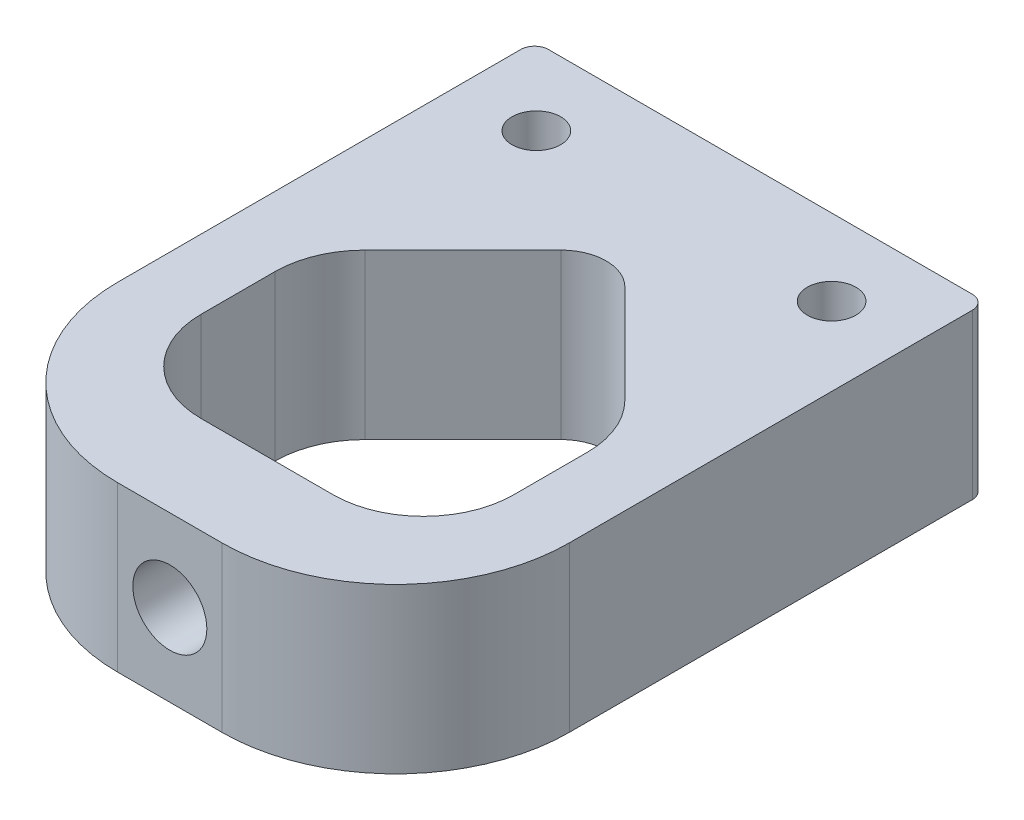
ISO-10303-21;
HEADER;
FILE_DESCRIPTION(('STEP AP214'),'2;1');
FILE_NAME('part.step','',(''),(''),'','','');
FILE_SCHEMA(('AUTOMOTIVE_DESIGN { 1 0 10303 214 1 1 1 1 }'));
ENDSEC;
DATA;
#1=APPLICATION_CONTEXT('core data for automotive mechanical design processes');
#2=APPLICATION_PROTOCOL_DEFINITION('international standard','automotive_design',2000,#1);
#3=PRODUCT_CONTEXT('',#1,'mechanical');
#4=PRODUCT('Part','Part','',(#3));
#5=PRODUCT_RELATED_PRODUCT_CATEGORY('part','',(#4));
#6=PRODUCT_DEFINITION_FORMATION('','',#4);
#7=PRODUCT_DEFINITION_CONTEXT('part definition',#1,'design');
#8=PRODUCT_DEFINITION('design','',#6,#7);
#9=PRODUCT_DEFINITION_SHAPE('','',#8);
#10=(LENGTH_UNIT() NAMED_UNIT(*) SI_UNIT(.MILLI.,.METRE.));
#11=(NAMED_UNIT(*) PLANE_ANGLE_UNIT() SI_UNIT($,.RADIAN.));
#12=(NAMED_UNIT(*) SI_UNIT($,.STERADIAN.) SOLID_ANGLE_UNIT());
#13=UNCERTAINTY_MEASURE_WITH_UNIT(LENGTH_MEASURE(1.E-05),#10,'distance_accuracy_value','');
#14=(GEOMETRIC_REPRESENTATION_CONTEXT(3) GLOBAL_UNCERTAINTY_ASSIGNED_CONTEXT((#13)) GLOBAL_UNIT_ASSIGNED_CONTEXT((#10,
#11,#12)) REPRESENTATION_CONTEXT('',''));
#15=CARTESIAN_POINT('',(0.,0.,0.));
#16=DIRECTION('',(0.,0.,1.));
#17=DIRECTION('',(1.,0.,0.));
#18=AXIS2_PLACEMENT_3D('',#15,#16,#17);
#19=CARTESIAN_POINT('',(-27.0045688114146,6.,-23.0124921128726));
#20=DIRECTION('',(1.,0.,0.));
#21=DIRECTION('',(0.,0.,-1.));
#22=AXIS2_PLACEMENT_3D('',#19,#20,#21);
#23=PLANE('',#22);
#24=DIRECTION('',(0.,0.,1.));
#25=VECTOR('',#24,1.);
#26=CARTESIAN_POINT('',(-27.0045688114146,0.,-23.0124921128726));
#27=LINE('',#26,#25);
#28=CARTESIAN_POINT('',(-27.0045688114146,0.,-22.5044921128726));
#29=VERTEX_POINT('',#28);
#30=CARTESIAN_POINT('',(-27.0045688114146,0.,-7.77249211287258));
#31=VERTEX_POINT('',#30);
#32=EDGE_CURVE('E179',#29,#31,#27,.T.);
#33=ORIENTED_EDGE('',*,*,#32,.T.);
#34=DIRECTION('',(0.,-1.,0.));
#35=VECTOR('',#34,1.);
#36=CARTESIAN_POINT('',(-27.0045688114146,6.,-7.77249211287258));
#37=LINE('',#36,#35);
#38=CARTESIAN_POINT('',(-27.0045688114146,6.,-7.77249211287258));
#39=VERTEX_POINT('',#38);
#40=EDGE_CURVE('E223',#31,#39,#37,.F.);
#41=ORIENTED_EDGE('',*,*,#40,.T.);
#42=DIRECTION('',(0.,0.,1.));
#43=VECTOR('',#42,1.);
#44=CARTESIAN_POINT('',(-27.0045688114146,6.,-23.0124921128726));
#45=LINE('',#44,#43);
#46=CARTESIAN_POINT('',(-27.0045688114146,6.,-22.5044921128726));
#47=VERTEX_POINT('',#46);
#48=EDGE_CURVE('E182',#47,#39,#45,.T.);
#49=ORIENTED_EDGE('',*,*,#48,.F.);
#50=DIRECTION('',(0.,-1.,0.));
#51=VECTOR('',#50,1.);
#52=CARTESIAN_POINT('',(-27.0045688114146,6.,-22.5044921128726));
#53=LINE('',#52,#51);
#54=EDGE_CURVE('E167',#47,#29,#53,.T.);
#55=ORIENTED_EDGE('',*,*,#54,.T.);
#56=EDGE_LOOP('',(#33,#41,#49,#55));
#57=FACE_BOUND('',#56,.T.);
#58=ADVANCED_FACE('F38',(#57),#23,.F.);
#59=CARTESIAN_POINT('',(-27.0045688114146,6.,-1.42249211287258));
#60=DIRECTION('',(0.,0.,-1.));
#61=DIRECTION('',(-1.,0.,0.));
#62=AXIS2_PLACEMENT_3D('',#59,#60,#61);
#63=PLANE('',#62);
#64=CARTESIAN_POINT('',(-18.7495688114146,3.,-1.42249211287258));
#65=DIRECTION('',(0.,0.,1.));
#66=DIRECTION('',(1.,0.,0.));
#67=AXIS2_PLACEMENT_3D('',#64,#65,#66);
#68=CIRCLE('',#67,1.35254999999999);
#69=CARTESIAN_POINT('',(-17.3970188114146,3.,-1.42249211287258));
#70=VERTEX_POINT('',#69);
#71=EDGE_CURVE('E292',#70,#70,#68,.T.);
#72=ORIENTED_EDGE('',*,*,#71,.F.);
#73=EDGE_LOOP('',(#72));
#74=FACE_BOUND('',#73,.T.);
#75=DIRECTION('',(1.,0.,0.));
#76=VECTOR('',#75,1.);
#77=CARTESIAN_POINT('',(-27.0045688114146,6.,-1.42249211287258));
#78=LINE('',#77,#76);
#79=CARTESIAN_POINT('',(-20.6545688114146,6.,-1.42249211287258));
#80=VERTEX_POINT('',#79);
#81=CARTESIAN_POINT('',(-16.8445688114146,6.,-1.42249211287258));
#82=VERTEX_POINT('',#81);
#83=EDGE_CURVE('E314',#80,#82,#78,.T.);
#84=ORIENTED_EDGE('',*,*,#83,.F.);
#85=DIRECTION('',(0.,-1.,0.));
#86=VECTOR('',#85,1.);
#87=CARTESIAN_POINT('',(-20.6545688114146,6.,-1.42249211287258));
#88=LINE('',#87,#86);
#89=CARTESIAN_POINT('',(-20.6545688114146,0.,-1.42249211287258));
#90=VERTEX_POINT('',#89);
#91=EDGE_CURVE('E217',#80,#90,#88,.T.);
#92=ORIENTED_EDGE('',*,*,#91,.T.);
#93=DIRECTION('',(1.,0.,0.));
#94=VECTOR('',#93,1.);
#95=CARTESIAN_POINT('',(-27.0045688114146,0.,-1.42249211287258));
#96=LINE('',#95,#94);
#97=CARTESIAN_POINT('',(-16.8445688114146,0.,-1.42249211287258));
#98=VERTEX_POINT('',#97);
#99=EDGE_CURVE('E188',#90,#98,#96,.T.);
#100=ORIENTED_EDGE('',*,*,#99,.T.);
#101=DIRECTION('',(0.,-1.,0.));
#102=VECTOR('',#101,1.);
#103=CARTESIAN_POINT('',(-16.8445688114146,6.,-1.42249211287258));
#104=LINE('',#103,#102);
#105=EDGE_CURVE('E215',#98,#82,#104,.F.);
#106=ORIENTED_EDGE('',*,*,#105,.T.);
#107=EDGE_LOOP('',(#84,#92,#100,#106));
#108=FACE_BOUND('',#107,.T.);
#109=ADVANCED_FACE('F338',(#74,#108),#63,.F.);
#110=CARTESIAN_POINT('',(-10.4945688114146,6.,-23.0124921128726));
#111=DIRECTION('',(-1.,0.,0.));
#112=DIRECTION('',(0.,0.,1.));
#113=AXIS2_PLACEMENT_3D('',#110,#111,#112);
#114=PLANE('',#113);
#115=DIRECTION('',(0.,0.,-1.));
#116=VECTOR('',#115,1.);
#117=CARTESIAN_POINT('',(-10.4945688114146,6.,-23.0124921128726));
#118=LINE('',#117,#116);
#119=CARTESIAN_POINT('',(-10.4945688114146,6.,-7.77249211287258));
#120=VERTEX_POINT('',#119);
#121=CARTESIAN_POINT('',(-10.4945688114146,6.,-22.5044921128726));
#122=VERTEX_POINT('',#121);
#123=EDGE_CURVE('E316',#120,#122,#118,.T.);
#124=ORIENTED_EDGE('',*,*,#123,.F.);
#125=DIRECTION('',(0.,-1.,0.));
#126=VECTOR('',#125,1.);
#127=CARTESIAN_POINT('',(-10.4945688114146,6.,-7.77249211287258));
#128=LINE('',#127,#126);
#129=CARTESIAN_POINT('',(-10.4945688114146,0.,-7.77249211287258));
#130=VERTEX_POINT('',#129);
#131=EDGE_CURVE('E229',#120,#130,#128,.T.);
#132=ORIENTED_EDGE('',*,*,#131,.T.);
#133=DIRECTION('',(0.,0.,-1.));
#134=VECTOR('',#133,1.);
#135=CARTESIAN_POINT('',(-10.4945688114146,0.,-23.0124921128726));
#136=LINE('',#135,#134);
#137=CARTESIAN_POINT('',(-10.4945688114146,0.,-22.5044921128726));
#138=VERTEX_POINT('',#137);
#139=EDGE_CURVE('E192',#130,#138,#136,.T.);
#140=ORIENTED_EDGE('',*,*,#139,.T.);
#141=DIRECTION('',(0.,-1.,0.));
#142=VECTOR('',#141,1.);
#143=CARTESIAN_POINT('',(-10.4945688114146,6.,-22.5044921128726));
#144=LINE('',#143,#142);
#145=EDGE_CURVE('E212',#138,#122,#144,.F.);
#146=ORIENTED_EDGE('',*,*,#145,.T.);
#147=EDGE_LOOP('',(#124,#132,#140,#146));
#148=FACE_BOUND('',#147,.T.);
#149=ADVANCED_FACE('F330',(#148),#114,.F.);
#150=CARTESIAN_POINT('',(-27.0045688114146,6.,-23.0124921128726));
#151=DIRECTION('',(0.,0.,1.));
#152=DIRECTION('',(1.,0.,0.));
#153=AXIS2_PLACEMENT_3D('',#150,#151,#152);
#154=PLANE('',#153);
#155=DIRECTION('',(-1.,0.,0.));
#156=VECTOR('',#155,1.);
#157=CARTESIAN_POINT('',(-27.0045688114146,0.,-23.0124921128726));
#158=LINE('',#157,#156);
#159=CARTESIAN_POINT('',(-11.0025688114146,0.,-23.0124921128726));
#160=VERTEX_POINT('',#159);
#161=CARTESIAN_POINT('',(-26.4965688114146,0.,-23.0124921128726));
#162=VERTEX_POINT('',#161);
#163=EDGE_CURVE('E201',#160,#162,#158,.T.);
#164=ORIENTED_EDGE('',*,*,#163,.T.);
#165=DIRECTION('',(0.,-1.,0.));
#166=VECTOR('',#165,1.);
#167=CARTESIAN_POINT('',(-26.4965688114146,6.,-23.0124921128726));
#168=LINE('',#167,#166);
#169=CARTESIAN_POINT('',(-26.4965688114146,6.,-23.0124921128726));
#170=VERTEX_POINT('',#169);
#171=EDGE_CURVE('E168',#162,#170,#168,.F.);
#172=ORIENTED_EDGE('',*,*,#171,.T.);
#173=DIRECTION('',(-1.,0.,0.));
#174=VECTOR('',#173,1.);
#175=CARTESIAN_POINT('',(-27.0045688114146,6.,-23.0124921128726));
#176=LINE('',#175,#174);
#177=CARTESIAN_POINT('',(-11.0025688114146,6.,-23.0124921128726));
#178=VERTEX_POINT('',#177);
#179=EDGE_CURVE('E183',#178,#170,#176,.T.);
#180=ORIENTED_EDGE('',*,*,#179,.F.);
#181=DIRECTION('',(0.,-1.,0.));
#182=VECTOR('',#181,1.);
#183=CARTESIAN_POINT('',(-11.0025688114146,6.,-23.0124921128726));
#184=LINE('',#183,#182);
#185=EDGE_CURVE('E173',#178,#160,#184,.T.);
#186=ORIENTED_EDGE('',*,*,#185,.T.);
#187=EDGE_LOOP('',(#164,#172,#180,#186));
#188=FACE_BOUND('',#187,.T.);
#189=ADVANCED_FACE('F324',(#188),#154,.F.);
#190=CARTESIAN_POINT('',(0.,6.,0.));
#191=DIRECTION('',(0.,1.,0.));
#192=DIRECTION('',(0.,0.,1.));
#193=AXIS2_PLACEMENT_3D('',#190,#191,#192);
#194=PLANE('',#193);
#195=DIRECTION('',(-0.707106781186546,0.,0.707106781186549));
#196=VECTOR('',#195,1.);
#197=CARTESIAN_POINT('',(-24.4645688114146,6.,-12.3444921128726));
#198=LINE('',#197,#196);
#199=CARTESIAN_POINT('',(-19.9170021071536,6.,-16.8920588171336));
#200=VERTEX_POINT('',#199);
#201=CARTESIAN_POINT('',(-23.4974354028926,6.,-13.3116255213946));
#202=VERTEX_POINT('',#201);
#203=EDGE_CURVE('E277',#200,#202,#198,.T.);
#204=ORIENTED_EDGE('',*,*,#203,.F.);
#205=CARTESIAN_POINT('',(-18.7495688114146,6.,-15.7246255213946));
#206=DIRECTION('',(0.,1.,0.));
#207=DIRECTION('',(0.,0.,1.));
#208=AXIS2_PLACEMENT_3D('',#205,#206,#207);
#209=CIRCLE('',#208,1.651);
#210=CARTESIAN_POINT('',(-17.5821355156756,6.,-16.8920588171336));
#211=VERTEX_POINT('',#210);
#212=EDGE_CURVE('E46',#200,#211,#209,.F.);
#213=ORIENTED_EDGE('',*,*,#212,.T.);
#214=DIRECTION('',(-0.707106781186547,0.,-0.707106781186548));
#215=VECTOR('',#214,1.);
#216=CARTESIAN_POINT('',(-18.7495688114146,6.,-18.0594921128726));
#217=LINE('',#216,#215);
#218=CARTESIAN_POINT('',(-14.0017022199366,6.,-13.3116255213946));
#219=VERTEX_POINT('',#218);
#220=EDGE_CURVE('E303',#219,#211,#217,.T.);
#221=ORIENTED_EDGE('',*,*,#220,.F.);
#222=CARTESIAN_POINT('',(-16.3365688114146,6.,-10.9767589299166));
#223=DIRECTION('',(0.,1.,0.));
#224=DIRECTION('',(0.,0.,1.));
#225=AXIS2_PLACEMENT_3D('',#222,#223,#224);
#226=CIRCLE('',#225,3.302);
#227=CARTESIAN_POINT('',(-13.0345688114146,6.,-10.9767589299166));
#228=VERTEX_POINT('',#227);
#229=EDGE_CURVE('E261',#219,#228,#226,.F.);
#230=ORIENTED_EDGE('',*,*,#229,.T.);
#231=DIRECTION('',(0.,0.,-1.));
#232=VECTOR('',#231,1.);
#233=CARTESIAN_POINT('',(-13.0345688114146,6.,-4.97849211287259));
#234=LINE('',#233,#232);
#235=CARTESIAN_POINT('',(-13.0345688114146,6.,-8.28049211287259));
#236=VERTEX_POINT('',#235);
#237=EDGE_CURVE('E300',#236,#228,#234,.T.);
#238=ORIENTED_EDGE('',*,*,#237,.F.);
#239=CARTESIAN_POINT('',(-16.3365688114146,6.,-8.28049211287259));
#240=DIRECTION('',(0.,1.,0.));
#241=DIRECTION('',(0.,0.,1.));
#242=AXIS2_PLACEMENT_3D('',#239,#240,#241);
#243=CIRCLE('',#242,3.302);
#244=CARTESIAN_POINT('',(-16.3365688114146,6.,-4.97849211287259));
#245=VERTEX_POINT('',#244);
#246=EDGE_CURVE('E253',#236,#245,#243,.F.);
#247=ORIENTED_EDGE('',*,*,#246,.T.);
#248=DIRECTION('',(1.,0.,0.));
#249=VECTOR('',#248,1.);
#250=CARTESIAN_POINT('',(-24.4645688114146,6.,-4.97849211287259));
#251=LINE('',#250,#249);
#252=CARTESIAN_POINT('',(-21.1625688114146,6.,-4.97849211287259));
#253=VERTEX_POINT('',#252);
#254=EDGE_CURVE('E289',#253,#245,#251,.T.);
#255=ORIENTED_EDGE('',*,*,#254,.F.);
#256=CARTESIAN_POINT('',(-21.1625688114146,6.,-8.28049211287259));
#257=DIRECTION('',(0.,1.,0.));
#258=DIRECTION('',(0.,0.,1.));
#259=AXIS2_PLACEMENT_3D('',#256,#257,#258);
#260=CIRCLE('',#259,3.302);
#261=CARTESIAN_POINT('',(-24.4645688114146,6.,-8.28049211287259));
#262=VERTEX_POINT('',#261);
#263=EDGE_CURVE('E257',#253,#262,#260,.F.);
#264=ORIENTED_EDGE('',*,*,#263,.T.);
#265=DIRECTION('',(0.,0.,1.));
#266=VECTOR('',#265,1.);
#267=CARTESIAN_POINT('',(-24.4645688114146,6.,-4.97849211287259));
#268=LINE('',#267,#266);
#269=CARTESIAN_POINT('',(-24.4645688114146,6.,-10.9767589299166));
#270=VERTEX_POINT('',#269);
#271=EDGE_CURVE('E285',#270,#262,#268,.T.);
#272=ORIENTED_EDGE('',*,*,#271,.F.);
#273=CARTESIAN_POINT('',(-21.1625688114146,6.,-10.9767589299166));
#274=DIRECTION('',(0.,1.,0.));
#275=DIRECTION('',(0.,0.,1.));
#276=AXIS2_PLACEMENT_3D('',#273,#274,#275);
#277=CIRCLE('',#276,3.302);
#278=EDGE_CURVE('E265',#270,#202,#277,.F.);
#279=ORIENTED_EDGE('',*,*,#278,.T.);
#280=EDGE_LOOP('',(#204,#213,#221,#230,#238,#247,#255,#264,#272,#279));
#281=FACE_BOUND('',#280,.T.);
#282=CARTESIAN_POINT('',(-24.1470688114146,6.,-20.2184921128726));
#283=DIRECTION('',(0.,1.,0.));
#284=DIRECTION('',(0.,0.,1.));
#285=AXIS2_PLACEMENT_3D('',#282,#283,#284);
#286=CIRCLE('',#285,0.889000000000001);
#287=CARTESIAN_POINT('',(-24.1470688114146,6.,-19.3294921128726));
#288=VERTEX_POINT('',#287);
#289=EDGE_CURVE('E305',#288,#288,#286,.T.);
#290=ORIENTED_EDGE('',*,*,#289,.F.);
#291=EDGE_LOOP('',(#290));
#292=FACE_BOUND('',#291,.T.);
#293=CARTESIAN_POINT('',(-13.3520688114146,6.,-20.2184921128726));
#294=DIRECTION('',(0.,1.,0.));
#295=DIRECTION('',(0.,0.,1.));
#296=AXIS2_PLACEMENT_3D('',#293,#294,#295);
#297=CIRCLE('',#296,0.888999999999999);
#298=CARTESIAN_POINT('',(-13.3520688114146,6.,-19.3294921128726));
#299=VERTEX_POINT('',#298);
#300=EDGE_CURVE('E195',#299,#299,#297,.T.);
#301=ORIENTED_EDGE('',*,*,#300,.F.);
#302=EDGE_LOOP('',(#301));
#303=FACE_BOUND('',#302,.T.);
#304=ORIENTED_EDGE('',*,*,#48,.T.);
#305=CARTESIAN_POINT('',(-20.6545688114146,6.,-7.77249211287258));
#306=DIRECTION('',(0.,1.,0.));
#307=DIRECTION('',(0.,0.,1.));
#308=AXIS2_PLACEMENT_3D('',#305,#306,#307);
#309=CIRCLE('',#308,6.35);
#310=EDGE_CURVE('E227',#39,#80,#309,.T.);
#311=ORIENTED_EDGE('',*,*,#310,.T.);
#312=ORIENTED_EDGE('',*,*,#83,.T.);
#313=CARTESIAN_POINT('',(-16.8445688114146,6.,-7.77249211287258));
#314=DIRECTION('',(0.,1.,0.));
#315=DIRECTION('',(0.,0.,1.));
#316=AXIS2_PLACEMENT_3D('',#313,#314,#315);
#317=CIRCLE('',#316,6.35);
#318=EDGE_CURVE('E225',#82,#120,#317,.T.);
#319=ORIENTED_EDGE('',*,*,#318,.T.);
#320=ORIENTED_EDGE('',*,*,#123,.T.);
#321=CARTESIAN_POINT('',(-11.0025688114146,6.,-22.5044921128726));
#322=DIRECTION('',(0.,1.,0.));
#323=DIRECTION('',(0.,0.,1.));
#324=AXIS2_PLACEMENT_3D('',#321,#322,#323);
#325=CIRCLE('',#324,0.508);
#326=EDGE_CURVE('E208',#122,#178,#325,.T.);
#327=ORIENTED_EDGE('',*,*,#326,.T.);
#328=ORIENTED_EDGE('',*,*,#179,.T.);
#329=CARTESIAN_POINT('',(-26.4965688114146,6.,-22.5044921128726));
#330=DIRECTION('',(0.,1.,0.));
#331=DIRECTION('',(0.,0.,1.));
#332=AXIS2_PLACEMENT_3D('',#329,#330,#331);
#333=CIRCLE('',#332,0.508);
#334=EDGE_CURVE('E210',#170,#47,#333,.T.);
#335=ORIENTED_EDGE('',*,*,#334,.T.);
#336=EDGE_LOOP('',(#304,#311,#312,#319,#320,#327,#328,#335));
#337=FACE_BOUND('',#336,.T.);
#338=ADVANCED_FACE('F281',(#281,#292,#303,#337),#194,.T.);
#339=CARTESIAN_POINT('',(0.,0.,0.));
#340=DIRECTION('',(0.,1.,0.));
#341=DIRECTION('',(0.,0.,1.));
#342=AXIS2_PLACEMENT_3D('',#339,#340,#341);
#343=PLANE('',#342);
#344=DIRECTION('',(0.,0.,-1.));
#345=VECTOR('',#344,1.);
#346=CARTESIAN_POINT('',(-13.0345688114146,0.,-4.97849211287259));
#347=LINE('',#346,#345);
#348=CARTESIAN_POINT('',(-13.0345688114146,0.,-8.28049211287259));
#349=VERTEX_POINT('',#348);
#350=CARTESIAN_POINT('',(-13.0345688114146,0.,-10.9767589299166));
#351=VERTEX_POINT('',#350);
#352=EDGE_CURVE('E584',#349,#351,#347,.T.);
#353=ORIENTED_EDGE('',*,*,#352,.T.);
#354=CARTESIAN_POINT('',(-16.3365688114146,0.,-10.9767589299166));
#355=DIRECTION('',(0.,1.,0.));
#356=DIRECTION('',(0.,0.,1.));
#357=AXIS2_PLACEMENT_3D('',#354,#355,#356);
#358=CIRCLE('',#357,3.302);
#359=CARTESIAN_POINT('',(-14.0017022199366,0.,-13.3116255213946));
#360=VERTEX_POINT('',#359);
#361=EDGE_CURVE('E263',#351,#360,#358,.T.);
#362=ORIENTED_EDGE('',*,*,#361,.T.);
#363=DIRECTION('',(-0.707106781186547,0.,-0.707106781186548));
#364=VECTOR('',#363,1.);
#365=CARTESIAN_POINT('',(-18.7495688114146,0.,-18.0594921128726));
#366=LINE('',#365,#364);
#367=CARTESIAN_POINT('',(-17.5821355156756,0.,-16.8920588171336));
#368=VERTEX_POINT('',#367);
#369=EDGE_CURVE('E295',#360,#368,#366,.T.);
#370=ORIENTED_EDGE('',*,*,#369,.T.);
#371=CARTESIAN_POINT('',(-18.7495688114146,0.,-15.7246255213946));
#372=DIRECTION('',(0.,1.,0.));
#373=DIRECTION('',(0.,0.,1.));
#374=AXIS2_PLACEMENT_3D('',#371,#372,#373);
#375=CIRCLE('',#374,1.651);
#376=CARTESIAN_POINT('',(-19.9170021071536,0.,-16.8920588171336));
#377=VERTEX_POINT('',#376);
#378=EDGE_CURVE('E11',#368,#377,#375,.T.);
#379=ORIENTED_EDGE('',*,*,#378,.T.);
#380=DIRECTION('',(-0.707106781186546,0.,0.707106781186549));
#381=VECTOR('',#380,1.);
#382=CARTESIAN_POINT('',(-24.4645688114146,0.,-12.3444921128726));
#383=LINE('',#382,#381);
#384=CARTESIAN_POINT('',(-23.4974354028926,0.,-13.3116255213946));
#385=VERTEX_POINT('',#384);
#386=EDGE_CURVE('E278',#377,#385,#383,.T.);
#387=ORIENTED_EDGE('',*,*,#386,.T.);
#388=CARTESIAN_POINT('',(-21.1625688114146,0.,-10.9767589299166));
#389=DIRECTION('',(0.,1.,0.));
#390=DIRECTION('',(0.,0.,1.));
#391=AXIS2_PLACEMENT_3D('',#388,#389,#390);
#392=CIRCLE('',#391,3.302);
#393=CARTESIAN_POINT('',(-24.4645688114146,0.,-10.9767589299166));
#394=VERTEX_POINT('',#393);
#395=EDGE_CURVE('E268',#385,#394,#392,.T.);
#396=ORIENTED_EDGE('',*,*,#395,.T.);
#397=DIRECTION('',(0.,0.,1.));
#398=VECTOR('',#397,1.);
#399=CARTESIAN_POINT('',(-24.4645688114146,0.,-4.97849211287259));
#400=LINE('',#399,#398);
#401=CARTESIAN_POINT('',(-24.4645688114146,0.,-8.28049211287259));
#402=VERTEX_POINT('',#401);
#403=EDGE_CURVE('E590',#394,#402,#400,.T.);
#404=ORIENTED_EDGE('',*,*,#403,.T.);
#405=CARTESIAN_POINT('',(-21.1625688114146,0.,-8.28049211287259));
#406=DIRECTION('',(0.,1.,0.));
#407=DIRECTION('',(0.,0.,1.));
#408=AXIS2_PLACEMENT_3D('',#405,#406,#407);
#409=CIRCLE('',#408,3.302);
#410=CARTESIAN_POINT('',(-21.1625688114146,0.,-4.97849211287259));
#411=VERTEX_POINT('',#410);
#412=EDGE_CURVE('E259',#402,#411,#409,.T.);
#413=ORIENTED_EDGE('',*,*,#412,.T.);
#414=DIRECTION('',(1.,0.,0.));
#415=VECTOR('',#414,1.);
#416=CARTESIAN_POINT('',(-24.4645688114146,0.,-4.97849211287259));
#417=LINE('',#416,#415);
#418=CARTESIAN_POINT('',(-16.3365688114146,0.,-4.97849211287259));
#419=VERTEX_POINT('',#418);
#420=EDGE_CURVE('E587',#411,#419,#417,.T.);
#421=ORIENTED_EDGE('',*,*,#420,.T.);
#422=CARTESIAN_POINT('',(-16.3365688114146,0.,-8.28049211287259));
#423=DIRECTION('',(0.,1.,0.));
#424=DIRECTION('',(0.,0.,1.));
#425=AXIS2_PLACEMENT_3D('',#422,#423,#424);
#426=CIRCLE('',#425,3.302);
#427=EDGE_CURVE('E255',#419,#349,#426,.T.);
#428=ORIENTED_EDGE('',*,*,#427,.T.);
#429=EDGE_LOOP('',(#353,#362,#370,#379,#387,#396,#404,#413,#421,#428));
#430=FACE_BOUND('',#429,.T.);
#431=CARTESIAN_POINT('',(-24.1470688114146,0.,-20.2184921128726));
#432=DIRECTION('',(0.,1.,0.));
#433=DIRECTION('',(0.,0.,1.));
#434=AXIS2_PLACEMENT_3D('',#431,#432,#433);
#435=CIRCLE('',#434,0.888999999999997);
#436=CARTESIAN_POINT('',(-24.1470688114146,0.,-19.3294921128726));
#437=VERTEX_POINT('',#436);
#438=EDGE_CURVE('E308',#437,#437,#435,.T.);
#439=ORIENTED_EDGE('',*,*,#438,.T.);
#440=EDGE_LOOP('',(#439));
#441=FACE_BOUND('',#440,.T.);
#442=CARTESIAN_POINT('',(-13.3520688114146,0.,-20.2184921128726));
#443=DIRECTION('',(0.,1.,0.));
#444=DIRECTION('',(0.,0.,1.));
#445=AXIS2_PLACEMENT_3D('',#442,#443,#444);
#446=CIRCLE('',#445,0.888999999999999);
#447=CARTESIAN_POINT('',(-13.3520688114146,0.,-19.3294921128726));
#448=VERTEX_POINT('',#447);
#449=EDGE_CURVE('E189',#448,#448,#446,.T.);
#450=ORIENTED_EDGE('',*,*,#449,.T.);
#451=EDGE_LOOP('',(#450));
#452=FACE_BOUND('',#451,.T.);
#453=ORIENTED_EDGE('',*,*,#99,.F.);
#454=CARTESIAN_POINT('',(-20.6545688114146,0.,-7.77249211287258));
#455=DIRECTION('',(0.,1.,0.));
#456=DIRECTION('',(0.,0.,1.));
#457=AXIS2_PLACEMENT_3D('',#454,#455,#456);
#458=CIRCLE('',#457,6.35);
#459=EDGE_CURVE('E187',#90,#31,#458,.F.);
#460=ORIENTED_EDGE('',*,*,#459,.T.);
#461=ORIENTED_EDGE('',*,*,#32,.F.);
#462=CARTESIAN_POINT('',(-26.4965688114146,0.,-22.5044921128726));
#463=DIRECTION('',(0.,1.,0.));
#464=DIRECTION('',(0.,0.,1.));
#465=AXIS2_PLACEMENT_3D('',#462,#463,#464);
#466=CIRCLE('',#465,0.508);
#467=EDGE_CURVE('E163',#29,#162,#466,.F.);
#468=ORIENTED_EDGE('',*,*,#467,.T.);
#469=ORIENTED_EDGE('',*,*,#163,.F.);
#470=CARTESIAN_POINT('',(-11.0025688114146,0.,-22.5044921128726));
#471=DIRECTION('',(0.,1.,0.));
#472=DIRECTION('',(0.,0.,1.));
#473=AXIS2_PLACEMENT_3D('',#470,#471,#472);
#474=CIRCLE('',#473,0.508);
#475=EDGE_CURVE('E174',#160,#138,#474,.F.);
#476=ORIENTED_EDGE('',*,*,#475,.T.);
#477=ORIENTED_EDGE('',*,*,#139,.F.);
#478=CARTESIAN_POINT('',(-16.8445688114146,0.,-7.77249211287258));
#479=DIRECTION('',(0.,1.,0.));
#480=DIRECTION('',(0.,0.,1.));
#481=AXIS2_PLACEMENT_3D('',#478,#479,#480);
#482=CIRCLE('',#481,6.35);
#483=EDGE_CURVE('E220',#130,#98,#482,.F.);
#484=ORIENTED_EDGE('',*,*,#483,.T.);
#485=EDGE_LOOP('',(#453,#460,#461,#468,#469,#476,#477,#484));
#486=FACE_BOUND('',#485,.T.);
#487=ADVANCED_FACE('F186',(#430,#441,#452,#486),#343,.F.);
#488=CARTESIAN_POINT('',(-13.3520688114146,6.,-20.2184921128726));
#489=DIRECTION('',(0.,1.,0.));
#490=DIRECTION('',(0.,0.,1.));
#491=AXIS2_PLACEMENT_3D('',#488,#489,#490);
#492=CYLINDRICAL_SURFACE('',#491,0.888999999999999);
#493=ORIENTED_EDGE('',*,*,#449,.F.);
#494=EDGE_LOOP('',(#493));
#495=FACE_BOUND('',#494,.T.);
#496=ORIENTED_EDGE('',*,*,#300,.T.);
#497=EDGE_LOOP('',(#496));
#498=FACE_BOUND('',#497,.T.);
#499=ADVANCED_FACE('F383',(#495,#498),#492,.F.);
#500=CARTESIAN_POINT('',(-24.1470688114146,6.,-20.2184921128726));
#501=DIRECTION('',(0.,1.,0.));
#502=DIRECTION('',(0.,0.,1.));
#503=AXIS2_PLACEMENT_3D('',#500,#501,#502);
#504=CYLINDRICAL_SURFACE('',#503,0.888999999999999);
#505=ORIENTED_EDGE('',*,*,#438,.F.);
#506=EDGE_LOOP('',(#505));
#507=FACE_BOUND('',#506,.T.);
#508=ORIENTED_EDGE('',*,*,#289,.T.);
#509=EDGE_LOOP('',(#508));
#510=FACE_BOUND('',#509,.T.);
#511=ADVANCED_FACE('F380',(#507,#510),#504,.F.);
#512=CARTESIAN_POINT('',(-24.4645688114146,0.,-12.3444921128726));
#513=DIRECTION('',(-0.707106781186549,0.,-0.707106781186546));
#514=DIRECTION('',(-0.707106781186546,0.,0.707106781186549));
#515=AXIS2_PLACEMENT_3D('',#512,#513,#514);
#516=PLANE('',#515);
#517=ORIENTED_EDGE('',*,*,#386,.F.);
#518=DIRECTION('',(0.,1.,0.));
#519=VECTOR('',#518,1.);
#520=CARTESIAN_POINT('',(-19.9170021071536,6.,-16.8920588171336));
#521=LINE('',#520,#519);
#522=EDGE_CURVE('E270',#377,#200,#521,.T.);
#523=ORIENTED_EDGE('',*,*,#522,.T.);
#524=ORIENTED_EDGE('',*,*,#203,.T.);
#525=DIRECTION('',(0.,1.,0.));
#526=VECTOR('',#525,1.);
#527=CARTESIAN_POINT('',(-23.4974354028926,0.,-13.3116255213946));
#528=LINE('',#527,#526);
#529=EDGE_CURVE('E250',#202,#385,#528,.F.);
#530=ORIENTED_EDGE('',*,*,#529,.T.);
#531=EDGE_LOOP('',(#517,#523,#524,#530));
#532=FACE_BOUND('',#531,.T.);
#533=ADVANCED_FACE('F276',(#532),#516,.F.);
#534=CARTESIAN_POINT('',(-18.7495688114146,0.,-18.0594921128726));
#535=DIRECTION('',(0.707106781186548,0.,-0.707106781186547));
#536=DIRECTION('',(-0.707106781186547,0.,-0.707106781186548));
#537=AXIS2_PLACEMENT_3D('',#534,#535,#536);
#538=PLANE('',#537);
#539=ORIENTED_EDGE('',*,*,#220,.T.);
#540=DIRECTION('',(0.,1.,0.));
#541=VECTOR('',#540,1.);
#542=CARTESIAN_POINT('',(-17.5821355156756,0.,-16.8920588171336));
#543=LINE('',#542,#541);
#544=EDGE_CURVE('E59',#211,#368,#543,.F.);
#545=ORIENTED_EDGE('',*,*,#544,.T.);
#546=ORIENTED_EDGE('',*,*,#369,.F.);
#547=DIRECTION('',(0.,1.,0.));
#548=VECTOR('',#547,1.);
#549=CARTESIAN_POINT('',(-14.0017022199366,6.,-13.3116255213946));
#550=LINE('',#549,#548);
#551=EDGE_CURVE('E247',#360,#219,#550,.T.);
#552=ORIENTED_EDGE('',*,*,#551,.T.);
#553=EDGE_LOOP('',(#539,#545,#546,#552));
#554=FACE_BOUND('',#553,.T.);
#555=ADVANCED_FACE('F379',(#554),#538,.F.);
#556=CARTESIAN_POINT('',(-13.0345688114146,0.,-4.97849211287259));
#557=DIRECTION('',(1.,0.,0.));
#558=DIRECTION('',(0.,0.,-1.));
#559=AXIS2_PLACEMENT_3D('',#556,#557,#558);
#560=PLANE('',#559);
#561=ORIENTED_EDGE('',*,*,#352,.F.);
#562=DIRECTION('',(0.,1.,0.));
#563=VECTOR('',#562,1.);
#564=CARTESIAN_POINT('',(-13.0345688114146,6.,-8.28049211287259));
#565=LINE('',#564,#563);
#566=EDGE_CURVE('E234',#349,#236,#565,.T.);
#567=ORIENTED_EDGE('',*,*,#566,.T.);
#568=ORIENTED_EDGE('',*,*,#237,.T.);
#569=DIRECTION('',(0.,1.,0.));
#570=VECTOR('',#569,1.);
#571=CARTESIAN_POINT('',(-13.0345688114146,0.,-10.9767589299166));
#572=LINE('',#571,#570);
#573=EDGE_CURVE('E232',#228,#351,#572,.F.);
#574=ORIENTED_EDGE('',*,*,#573,.T.);
#575=EDGE_LOOP('',(#561,#567,#568,#574));
#576=FACE_BOUND('',#575,.T.);
#577=ADVANCED_FACE('F372',(#576),#560,.F.);
#578=CARTESIAN_POINT('',(-24.4645688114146,0.,-4.97849211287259));
#579=DIRECTION('',(0.,0.,1.));
#580=DIRECTION('',(1.,0.,0.));
#581=AXIS2_PLACEMENT_3D('',#578,#579,#580);
#582=PLANE('',#581);
#583=CARTESIAN_POINT('',(-18.7495688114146,3.,-4.97849211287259));
#584=DIRECTION('',(0.,0.,1.));
#585=DIRECTION('',(1.,0.,0.));
#586=AXIS2_PLACEMENT_3D('',#583,#584,#585);
#587=CIRCLE('',#586,1.35254999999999);
#588=CARTESIAN_POINT('',(-17.3970188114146,3.,-4.97849211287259));
#589=VERTEX_POINT('',#588);
#590=EDGE_CURVE('E286',#589,#589,#587,.T.);
#591=ORIENTED_EDGE('',*,*,#590,.T.);
#592=EDGE_LOOP('',(#591));
#593=FACE_BOUND('',#592,.T.);
#594=ORIENTED_EDGE('',*,*,#254,.T.);
#595=DIRECTION('',(0.,1.,0.));
#596=VECTOR('',#595,1.);
#597=CARTESIAN_POINT('',(-16.3365688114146,0.,-4.97849211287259));
#598=LINE('',#597,#596);
#599=EDGE_CURVE('E240',#245,#419,#598,.F.);
#600=ORIENTED_EDGE('',*,*,#599,.T.);
#601=ORIENTED_EDGE('',*,*,#420,.F.);
#602=DIRECTION('',(0.,1.,0.));
#603=VECTOR('',#602,1.);
#604=CARTESIAN_POINT('',(-21.1625688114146,6.,-4.97849211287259));
#605=LINE('',#604,#603);
#606=EDGE_CURVE('E237',#411,#253,#605,.T.);
#607=ORIENTED_EDGE('',*,*,#606,.T.);
#608=EDGE_LOOP('',(#594,#600,#601,#607));
#609=FACE_BOUND('',#608,.T.);
#610=ADVANCED_FACE('F366',(#593,#609),#582,.F.);
#611=CARTESIAN_POINT('',(-24.4645688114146,0.,-4.97849211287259));
#612=DIRECTION('',(-1.,0.,0.));
#613=DIRECTION('',(0.,0.,1.));
#614=AXIS2_PLACEMENT_3D('',#611,#612,#613);
#615=PLANE('',#614);
#616=ORIENTED_EDGE('',*,*,#271,.T.);
#617=DIRECTION('',(0.,1.,0.));
#618=VECTOR('',#617,1.);
#619=CARTESIAN_POINT('',(-24.4645688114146,0.,-8.28049211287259));
#620=LINE('',#619,#618);
#621=EDGE_CURVE('E245',#262,#402,#620,.F.);
#622=ORIENTED_EDGE('',*,*,#621,.T.);
#623=ORIENTED_EDGE('',*,*,#403,.F.);
#624=DIRECTION('',(0.,1.,0.));
#625=VECTOR('',#624,1.);
#626=CARTESIAN_POINT('',(-24.4645688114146,6.,-10.9767589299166));
#627=LINE('',#626,#625);
#628=EDGE_CURVE('E242',#394,#270,#627,.T.);
#629=ORIENTED_EDGE('',*,*,#628,.T.);
#630=EDGE_LOOP('',(#616,#622,#623,#629));
#631=FACE_BOUND('',#630,.T.);
#632=ADVANCED_FACE('F362',(#631),#615,.F.);
#633=CARTESIAN_POINT('',(-26.4965688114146,6.,-22.5044921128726));
#634=DIRECTION('',(0.,-1.,0.));
#635=DIRECTION('',(0.,0.,-1.));
#636=AXIS2_PLACEMENT_3D('',#633,#634,#635);
#637=CYLINDRICAL_SURFACE('',#636,0.508);
#638=ORIENTED_EDGE('',*,*,#334,.F.);
#639=ORIENTED_EDGE('',*,*,#171,.F.);
#640=ORIENTED_EDGE('',*,*,#467,.F.);
#641=ORIENTED_EDGE('',*,*,#54,.F.);
#642=EDGE_LOOP('',(#638,#639,#640,#641));
#643=FACE_BOUND('',#642,.T.);
#644=ADVANCED_FACE('F166',(#643),#637,.T.);
#645=CARTESIAN_POINT('',(-11.0025688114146,6.,-22.5044921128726));
#646=DIRECTION('',(0.,-1.,0.));
#647=DIRECTION('',(0.,0.,-1.));
#648=AXIS2_PLACEMENT_3D('',#645,#646,#647);
#649=CYLINDRICAL_SURFACE('',#648,0.508);
#650=ORIENTED_EDGE('',*,*,#326,.F.);
#651=ORIENTED_EDGE('',*,*,#145,.F.);
#652=ORIENTED_EDGE('',*,*,#475,.F.);
#653=ORIENTED_EDGE('',*,*,#185,.F.);
#654=EDGE_LOOP('',(#650,#651,#652,#653));
#655=FACE_BOUND('',#654,.T.);
#656=ADVANCED_FACE('F326',(#655),#649,.T.);
#657=CARTESIAN_POINT('',(-20.6545688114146,6.,-7.77249211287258));
#658=DIRECTION('',(0.,-1.,0.));
#659=DIRECTION('',(0.,0.,-1.));
#660=AXIS2_PLACEMENT_3D('',#657,#658,#659);
#661=CYLINDRICAL_SURFACE('',#660,6.35);
#662=ORIENTED_EDGE('',*,*,#310,.F.);
#663=ORIENTED_EDGE('',*,*,#40,.F.);
#664=ORIENTED_EDGE('',*,*,#459,.F.);
#665=ORIENTED_EDGE('',*,*,#91,.F.);
#666=EDGE_LOOP('',(#662,#663,#664,#665));
#667=FACE_BOUND('',#666,.T.);
#668=ADVANCED_FACE('F342',(#667),#661,.T.);
#669=CARTESIAN_POINT('',(-16.8445688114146,6.,-7.77249211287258));
#670=DIRECTION('',(0.,-1.,0.));
#671=DIRECTION('',(0.,0.,-1.));
#672=AXIS2_PLACEMENT_3D('',#669,#670,#671);
#673=CYLINDRICAL_SURFACE('',#672,6.35);
#674=ORIENTED_EDGE('',*,*,#318,.F.);
#675=ORIENTED_EDGE('',*,*,#105,.F.);
#676=ORIENTED_EDGE('',*,*,#483,.F.);
#677=ORIENTED_EDGE('',*,*,#131,.F.);
#678=EDGE_LOOP('',(#674,#675,#676,#677));
#679=FACE_BOUND('',#678,.T.);
#680=ADVANCED_FACE('F334',(#679),#673,.T.);
#681=CARTESIAN_POINT('',(-16.3365688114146,0.,-8.28049211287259));
#682=DIRECTION('',(0.,-1.,0.));
#683=DIRECTION('',(0.,0.,-1.));
#684=AXIS2_PLACEMENT_3D('',#681,#682,#683);
#685=CYLINDRICAL_SURFACE('',#684,3.302);
#686=ORIENTED_EDGE('',*,*,#427,.F.);
#687=ORIENTED_EDGE('',*,*,#599,.F.);
#688=ORIENTED_EDGE('',*,*,#246,.F.);
#689=ORIENTED_EDGE('',*,*,#566,.F.);
#690=EDGE_LOOP('',(#686,#687,#688,#689));
#691=FACE_BOUND('',#690,.T.);
#692=ADVANCED_FACE('F349',(#691),#685,.F.);
#693=CARTESIAN_POINT('',(-21.1625688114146,0.,-8.28049211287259));
#694=DIRECTION('',(0.,-1.,0.));
#695=DIRECTION('',(0.,0.,-1.));
#696=AXIS2_PLACEMENT_3D('',#693,#694,#695);
#697=CYLINDRICAL_SURFACE('',#696,3.302);
#698=ORIENTED_EDGE('',*,*,#412,.F.);
#699=ORIENTED_EDGE('',*,*,#621,.F.);
#700=ORIENTED_EDGE('',*,*,#263,.F.);
#701=ORIENTED_EDGE('',*,*,#606,.F.);
#702=EDGE_LOOP('',(#698,#699,#700,#701));
#703=FACE_BOUND('',#702,.T.);
#704=ADVANCED_FACE('F482',(#703),#697,.F.);
#705=CARTESIAN_POINT('',(-16.3365688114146,0.,-10.9767589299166));
#706=DIRECTION('',(0.,-1.,0.));
#707=DIRECTION('',(0.,0.,-1.));
#708=AXIS2_PLACEMENT_3D('',#705,#706,#707);
#709=CYLINDRICAL_SURFACE('',#708,3.302);
#710=ORIENTED_EDGE('',*,*,#361,.F.);
#711=ORIENTED_EDGE('',*,*,#573,.F.);
#712=ORIENTED_EDGE('',*,*,#229,.F.);
#713=ORIENTED_EDGE('',*,*,#551,.F.);
#714=EDGE_LOOP('',(#710,#711,#712,#713));
#715=FACE_BOUND('',#714,.T.);
#716=ADVANCED_FACE('F475',(#715),#709,.F.);
#717=CARTESIAN_POINT('',(-21.1625688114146,0.,-10.9767589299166));
#718=DIRECTION('',(0.,-1.,0.));
#719=DIRECTION('',(0.,0.,-1.));
#720=AXIS2_PLACEMENT_3D('',#717,#718,#719);
#721=CYLINDRICAL_SURFACE('',#720,3.302);
#722=ORIENTED_EDGE('',*,*,#395,.F.);
#723=ORIENTED_EDGE('',*,*,#529,.F.);
#724=ORIENTED_EDGE('',*,*,#278,.F.);
#725=ORIENTED_EDGE('',*,*,#628,.F.);
#726=EDGE_LOOP('',(#722,#723,#724,#725));
#727=FACE_BOUND('',#726,.T.);
#728=ADVANCED_FACE('F470',(#727),#721,.F.);
#729=CARTESIAN_POINT('',(-18.7495688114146,0.,-15.7246255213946));
#730=DIRECTION('',(0.,-1.,0.));
#731=DIRECTION('',(0.,0.,-1.));
#732=AXIS2_PLACEMENT_3D('',#729,#730,#731);
#733=CYLINDRICAL_SURFACE('',#732,1.651);
#734=ORIENTED_EDGE('',*,*,#378,.F.);
#735=ORIENTED_EDGE('',*,*,#544,.F.);
#736=ORIENTED_EDGE('',*,*,#212,.F.);
#737=ORIENTED_EDGE('',*,*,#522,.F.);
#738=EDGE_LOOP('',(#734,#735,#736,#737));
#739=FACE_BOUND('',#738,.T.);
#740=ADVANCED_FACE('F40',(#739),#733,.F.);
#741=CARTESIAN_POINT('',(-18.7495688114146,3.,-1.42249211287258));
#742=DIRECTION('',(0.,0.,1.));
#743=DIRECTION('',(1.,0.,0.));
#744=AXIS2_PLACEMENT_3D('',#741,#742,#743);
#745=CYLINDRICAL_SURFACE('',#744,1.35254999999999);
#746=ORIENTED_EDGE('',*,*,#590,.F.);
#747=EDGE_LOOP('',(#746));
#748=FACE_BOUND('',#747,.T.);
#749=ORIENTED_EDGE('',*,*,#71,.T.);
#750=EDGE_LOOP('',(#749));
#751=FACE_BOUND('',#750,.T.);
#752=ADVANCED_FACE('F455',(#748,#751),#745,.F.);
#753=CLOSED_SHELL('',(#58,#109,#149,#189,#338,#487,#499,#511,#533,#555,#577,#610,#632,#644,#656,
#668,#680,#692,#704,#716,#728,#740,#752));
#754=MANIFOLD_SOLID_BREP('B2',#753);
#755=ADVANCED_BREP_SHAPE_REPRESENTATION('',(#18,#754),#14);
#756=SHAPE_DEFINITION_REPRESENTATION(#9,#755);
ENDSEC;
END-ISO-10303-21;
